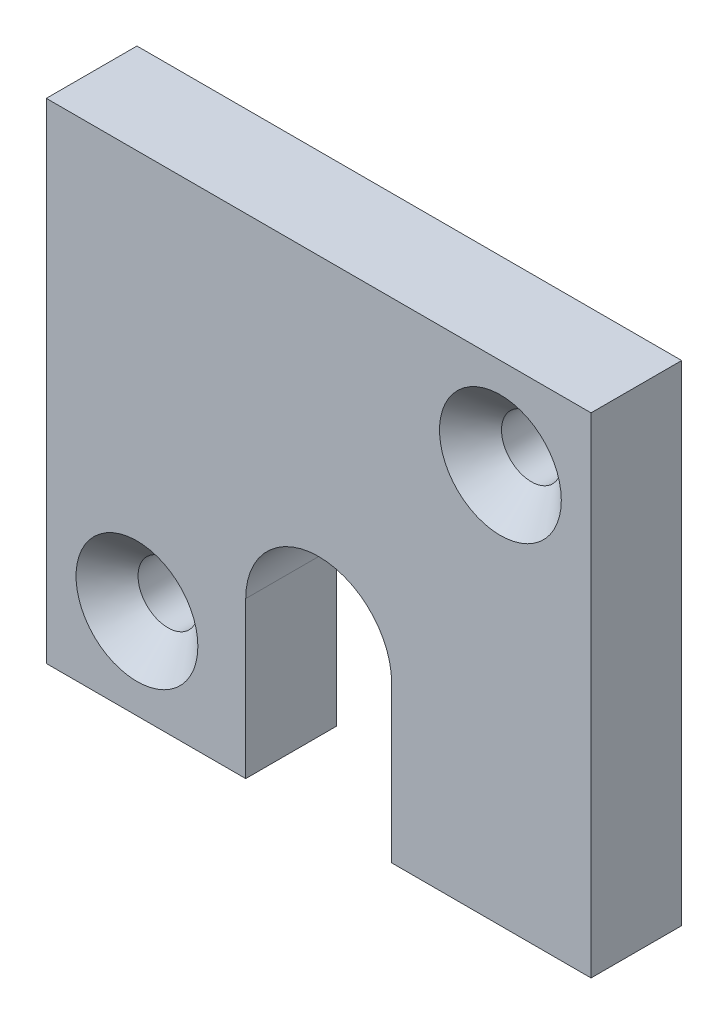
ISO-10303-21;
HEADER;
FILE_DESCRIPTION(('STEP AP214'),'2;1');
FILE_NAME('part.step','',(''),(''),'','','');
FILE_SCHEMA(('AUTOMOTIVE_DESIGN { 1 0 10303 214 1 1 1 1 }'));
ENDSEC;
DATA;
#1=APPLICATION_CONTEXT('core data for automotive mechanical design processes');
#2=APPLICATION_PROTOCOL_DEFINITION('international standard','automotive_design',2000,#1);
#3=PRODUCT_CONTEXT('',#1,'mechanical');
#4=PRODUCT('Part','Part','',(#3));
#5=PRODUCT_RELATED_PRODUCT_CATEGORY('part','',(#4));
#6=PRODUCT_DEFINITION_FORMATION('','',#4);
#7=PRODUCT_DEFINITION_CONTEXT('part definition',#1,'design');
#8=PRODUCT_DEFINITION('design','',#6,#7);
#9=PRODUCT_DEFINITION_SHAPE('','',#8);
#10=(LENGTH_UNIT() NAMED_UNIT(*) SI_UNIT(.MILLI.,.METRE.));
#11=(NAMED_UNIT(*) PLANE_ANGLE_UNIT() SI_UNIT($,.RADIAN.));
#12=(NAMED_UNIT(*) SI_UNIT($,.STERADIAN.) SOLID_ANGLE_UNIT());
#13=UNCERTAINTY_MEASURE_WITH_UNIT(LENGTH_MEASURE(1.E-05),#10,'distance_accuracy_value','');
#14=(GEOMETRIC_REPRESENTATION_CONTEXT(3) GLOBAL_UNCERTAINTY_ASSIGNED_CONTEXT((#13)) GLOBAL_UNIT_ASSIGNED_CONTEXT((#10,
#11,#12)) REPRESENTATION_CONTEXT('',''));
#15=CARTESIAN_POINT('',(0.,0.,0.));
#16=DIRECTION('',(0.,0.,1.));
#17=DIRECTION('',(1.,0.,0.));
#18=AXIS2_PLACEMENT_3D('',#15,#16,#17);
#19=CARTESIAN_POINT('',(0.,0.,10.));
#20=DIRECTION('',(1.,0.,0.));
#21=DIRECTION('',(0.,0.,-1.));
#22=AXIS2_PLACEMENT_3D('',#19,#20,#21);
#23=PLANE('',#22);
#24=DIRECTION('',(0.,-1.,0.));
#25=VECTOR('',#24,1.);
#26=CARTESIAN_POINT('',(0.,0.,0.));
#27=LINE('',#26,#25);
#28=CARTESIAN_POINT('',(0.,54.,0.));
#29=VERTEX_POINT('',#28);
#30=CARTESIAN_POINT('',(0.,0.,0.));
#31=VERTEX_POINT('',#30);
#32=EDGE_CURVE('E100',#29,#31,#27,.T.);
#33=ORIENTED_EDGE('',*,*,#32,.T.);
#34=DIRECTION('',(0.,0.,-1.));
#35=VECTOR('',#34,1.);
#36=CARTESIAN_POINT('',(0.,0.,10.));
#37=LINE('',#36,#35);
#38=CARTESIAN_POINT('',(0.,0.,10.));
#39=VERTEX_POINT('',#38);
#40=EDGE_CURVE('E11',#39,#31,#37,.T.);
#41=ORIENTED_EDGE('',*,*,#40,.F.);
#42=DIRECTION('',(0.,-1.,0.));
#43=VECTOR('',#42,1.);
#44=CARTESIAN_POINT('',(0.,0.,10.));
#45=LINE('',#44,#43);
#46=CARTESIAN_POINT('',(0.,54.,10.));
#47=VERTEX_POINT('',#46);
#48=EDGE_CURVE('E132',#47,#39,#45,.T.);
#49=ORIENTED_EDGE('',*,*,#48,.F.);
#50=DIRECTION('',(0.,0.,-1.));
#51=VECTOR('',#50,1.);
#52=CARTESIAN_POINT('',(0.,54.,10.));
#53=LINE('',#52,#51);
#54=EDGE_CURVE('E113',#47,#29,#53,.T.);
#55=ORIENTED_EDGE('',*,*,#54,.T.);
#56=EDGE_LOOP('',(#33,#41,#49,#55));
#57=FACE_BOUND('',#56,.T.);
#58=ADVANCED_FACE('F32',(#57),#23,.F.);
#59=CARTESIAN_POINT('',(0.,0.,10.));
#60=DIRECTION('',(0.,1.,0.));
#61=DIRECTION('',(0.,0.,1.));
#62=AXIS2_PLACEMENT_3D('',#59,#60,#61);
#63=PLANE('',#62);
#64=DIRECTION('',(1.,0.,0.));
#65=VECTOR('',#64,1.);
#66=CARTESIAN_POINT('',(0.,0.,0.));
#67=LINE('',#66,#65);
#68=CARTESIAN_POINT('',(22.,0.,0.));
#69=VERTEX_POINT('',#68);
#70=EDGE_CURVE('E96',#31,#69,#67,.T.);
#71=ORIENTED_EDGE('',*,*,#70,.T.);
#72=DIRECTION('',(0.,0.,-1.));
#73=VECTOR('',#72,1.);
#74=CARTESIAN_POINT('',(22.,0.,10.));
#75=LINE('',#74,#73);
#76=CARTESIAN_POINT('',(22.,0.,10.));
#77=VERTEX_POINT('',#76);
#78=EDGE_CURVE('E39',#77,#69,#75,.T.);
#79=ORIENTED_EDGE('',*,*,#78,.F.);
#80=DIRECTION('',(1.,0.,0.));
#81=VECTOR('',#80,1.);
#82=CARTESIAN_POINT('',(0.,0.,10.));
#83=LINE('',#82,#81);
#84=EDGE_CURVE('E109',#39,#77,#83,.T.);
#85=ORIENTED_EDGE('',*,*,#84,.F.);
#86=ORIENTED_EDGE('',*,*,#40,.T.);
#87=EDGE_LOOP('',(#71,#79,#85,#86));
#88=FACE_BOUND('',#87,.T.);
#89=ADVANCED_FACE('F108',(#88),#63,.F.);
#90=CARTESIAN_POINT('',(22.,0.,10.));
#91=DIRECTION('',(-1.,0.,0.));
#92=DIRECTION('',(0.,0.,1.));
#93=AXIS2_PLACEMENT_3D('',#90,#91,#92);
#94=PLANE('',#93);
#95=DIRECTION('',(0.,1.,0.));
#96=VECTOR('',#95,1.);
#97=CARTESIAN_POINT('',(22.,0.,0.));
#98=LINE('',#97,#96);
#99=CARTESIAN_POINT('',(22.,17.2,0.));
#100=VERTEX_POINT('',#99);
#101=EDGE_CURVE('E102',#69,#100,#98,.T.);
#102=ORIENTED_EDGE('',*,*,#101,.T.);
#103=DIRECTION('',(0.,0.,-1.));
#104=VECTOR('',#103,1.);
#105=CARTESIAN_POINT('',(22.,17.2,10.));
#106=LINE('',#105,#104);
#107=CARTESIAN_POINT('',(22.,17.2,10.));
#108=VERTEX_POINT('',#107);
#109=EDGE_CURVE('E158',#108,#100,#106,.T.);
#110=ORIENTED_EDGE('',*,*,#109,.F.);
#111=DIRECTION('',(0.,1.,0.));
#112=VECTOR('',#111,1.);
#113=CARTESIAN_POINT('',(22.,0.,10.));
#114=LINE('',#113,#112);
#115=EDGE_CURVE('E135',#77,#108,#114,.T.);
#116=ORIENTED_EDGE('',*,*,#115,.F.);
#117=ORIENTED_EDGE('',*,*,#78,.T.);
#118=EDGE_LOOP('',(#102,#110,#116,#117));
#119=FACE_BOUND('',#118,.T.);
#120=ADVANCED_FACE('F162',(#119),#94,.F.);
#121=CARTESIAN_POINT('',(30.05,17.2,10.));
#122=DIRECTION('',(0.,0.,-1.));
#123=DIRECTION('',(-1.,0.,0.));
#124=AXIS2_PLACEMENT_3D('',#121,#122,#123);
#125=CYLINDRICAL_SURFACE('',#124,8.05);
#126=CARTESIAN_POINT('',(30.05,17.2,0.));
#127=DIRECTION('',(0.,0.,-1.));
#128=DIRECTION('',(1.,0.,0.));
#129=AXIS2_PLACEMENT_3D('',#126,#127,#128);
#130=CIRCLE('',#129,8.05);
#131=CARTESIAN_POINT('',(38.1,17.2,0.));
#132=VERTEX_POINT('',#131);
#133=EDGE_CURVE('E122',#100,#132,#130,.T.);
#134=ORIENTED_EDGE('',*,*,#133,.T.);
#135=DIRECTION('',(0.,0.,-1.));
#136=VECTOR('',#135,1.);
#137=CARTESIAN_POINT('',(38.1,17.2,10.));
#138=LINE('',#137,#136);
#139=CARTESIAN_POINT('',(38.1,17.2,10.));
#140=VERTEX_POINT('',#139);
#141=EDGE_CURVE('E155',#140,#132,#138,.T.);
#142=ORIENTED_EDGE('',*,*,#141,.F.);
#143=CARTESIAN_POINT('',(30.05,17.2,10.));
#144=DIRECTION('',(0.,0.,-1.));
#145=DIRECTION('',(1.,0.,0.));
#146=AXIS2_PLACEMENT_3D('',#143,#144,#145);
#147=CIRCLE('',#146,8.05);
#148=EDGE_CURVE('E137',#108,#140,#147,.T.);
#149=ORIENTED_EDGE('',*,*,#148,.F.);
#150=ORIENTED_EDGE('',*,*,#109,.T.);
#151=EDGE_LOOP('',(#134,#142,#149,#150));
#152=FACE_BOUND('',#151,.T.);
#153=ADVANCED_FACE('F170',(#152),#125,.F.);
#154=CARTESIAN_POINT('',(38.1,0.,10.));
#155=DIRECTION('',(1.,0.,0.));
#156=DIRECTION('',(0.,1.,0.));
#157=AXIS2_PLACEMENT_3D('',#154,#155,#156);
#158=PLANE('',#157);
#159=DIRECTION('',(0.,-1.,0.));
#160=VECTOR('',#159,1.);
#161=CARTESIAN_POINT('',(38.1,0.,0.));
#162=LINE('',#161,#160);
#163=CARTESIAN_POINT('',(38.1,0.,0.));
#164=VERTEX_POINT('',#163);
#165=EDGE_CURVE('E124',#132,#164,#162,.T.);
#166=ORIENTED_EDGE('',*,*,#165,.T.);
#167=DIRECTION('',(0.,0.,-1.));
#168=VECTOR('',#167,1.);
#169=CARTESIAN_POINT('',(38.1,0.,10.));
#170=LINE('',#169,#168);
#171=CARTESIAN_POINT('',(38.1,0.,10.));
#172=VERTEX_POINT('',#171);
#173=EDGE_CURVE('E152',#172,#164,#170,.T.);
#174=ORIENTED_EDGE('',*,*,#173,.F.);
#175=DIRECTION('',(0.,-1.,0.));
#176=VECTOR('',#175,1.);
#177=CARTESIAN_POINT('',(38.1,0.,10.));
#178=LINE('',#177,#176);
#179=EDGE_CURVE('E139',#140,#172,#178,.T.);
#180=ORIENTED_EDGE('',*,*,#179,.F.);
#181=ORIENTED_EDGE('',*,*,#141,.T.);
#182=EDGE_LOOP('',(#166,#174,#180,#181));
#183=FACE_BOUND('',#182,.T.);
#184=ADVANCED_FACE('F173',(#183),#158,.F.);
#185=CARTESIAN_POINT('',(38.1,0.,10.));
#186=DIRECTION('',(0.,1.,0.));
#187=DIRECTION('',(0.,0.,1.));
#188=AXIS2_PLACEMENT_3D('',#185,#186,#187);
#189=PLANE('',#188);
#190=DIRECTION('',(1.,0.,0.));
#191=VECTOR('',#190,1.);
#192=CARTESIAN_POINT('',(38.1,0.,0.));
#193=LINE('',#192,#191);
#194=CARTESIAN_POINT('',(60.1,0.,0.));
#195=VERTEX_POINT('',#194);
#196=EDGE_CURVE('E126',#164,#195,#193,.T.);
#197=ORIENTED_EDGE('',*,*,#196,.T.);
#198=DIRECTION('',(0.,0.,-1.));
#199=VECTOR('',#198,1.);
#200=CARTESIAN_POINT('',(60.1,0.,10.));
#201=LINE('',#200,#199);
#202=CARTESIAN_POINT('',(60.1,0.,10.));
#203=VERTEX_POINT('',#202);
#204=EDGE_CURVE('E149',#203,#195,#201,.T.);
#205=ORIENTED_EDGE('',*,*,#204,.F.);
#206=DIRECTION('',(1.,0.,0.));
#207=VECTOR('',#206,1.);
#208=CARTESIAN_POINT('',(38.1,0.,10.));
#209=LINE('',#208,#207);
#210=EDGE_CURVE('E141',#172,#203,#209,.T.);
#211=ORIENTED_EDGE('',*,*,#210,.F.);
#212=ORIENTED_EDGE('',*,*,#173,.T.);
#213=EDGE_LOOP('',(#197,#205,#211,#212));
#214=FACE_BOUND('',#213,.T.);
#215=ADVANCED_FACE('F178',(#214),#189,.F.);
#216=CARTESIAN_POINT('',(60.1,0.,10.));
#217=DIRECTION('',(-1.,0.,0.));
#218=DIRECTION('',(0.,0.,1.));
#219=AXIS2_PLACEMENT_3D('',#216,#217,#218);
#220=PLANE('',#219);
#221=DIRECTION('',(0.,1.,0.));
#222=VECTOR('',#221,1.);
#223=CARTESIAN_POINT('',(60.1,0.,0.));
#224=LINE('',#223,#222);
#225=CARTESIAN_POINT('',(60.1,54.,0.));
#226=VERTEX_POINT('',#225);
#227=EDGE_CURVE('E128',#195,#226,#224,.T.);
#228=ORIENTED_EDGE('',*,*,#227,.T.);
#229=DIRECTION('',(0.,0.,-1.));
#230=VECTOR('',#229,1.);
#231=CARTESIAN_POINT('',(60.1,54.,10.));
#232=LINE('',#231,#230);
#233=CARTESIAN_POINT('',(60.1,54.,10.));
#234=VERTEX_POINT('',#233);
#235=EDGE_CURVE('E146',#234,#226,#232,.T.);
#236=ORIENTED_EDGE('',*,*,#235,.F.);
#237=DIRECTION('',(0.,1.,0.));
#238=VECTOR('',#237,1.);
#239=CARTESIAN_POINT('',(60.1,0.,10.));
#240=LINE('',#239,#238);
#241=EDGE_CURVE('E51',#203,#234,#240,.T.);
#242=ORIENTED_EDGE('',*,*,#241,.F.);
#243=ORIENTED_EDGE('',*,*,#204,.T.);
#244=EDGE_LOOP('',(#228,#236,#242,#243));
#245=FACE_BOUND('',#244,.T.);
#246=ADVANCED_FACE('F181',(#245),#220,.F.);
#247=CARTESIAN_POINT('',(0.,54.,10.));
#248=DIRECTION('',(0.,-1.,0.));
#249=DIRECTION('',(0.,0.,-1.));
#250=AXIS2_PLACEMENT_3D('',#247,#248,#249);
#251=PLANE('',#250);
#252=DIRECTION('',(-1.,0.,0.));
#253=VECTOR('',#252,1.);
#254=CARTESIAN_POINT('',(0.,54.,0.));
#255=LINE('',#254,#253);
#256=EDGE_CURVE('E130',#226,#29,#255,.T.);
#257=ORIENTED_EDGE('',*,*,#256,.T.);
#258=ORIENTED_EDGE('',*,*,#54,.F.);
#259=DIRECTION('',(-1.,0.,0.));
#260=VECTOR('',#259,1.);
#261=CARTESIAN_POINT('',(0.,54.,10.));
#262=LINE('',#261,#260);
#263=EDGE_CURVE('E46',#234,#47,#262,.T.);
#264=ORIENTED_EDGE('',*,*,#263,.F.);
#265=ORIENTED_EDGE('',*,*,#235,.T.);
#266=EDGE_LOOP('',(#257,#258,#264,#265));
#267=FACE_BOUND('',#266,.T.);
#268=ADVANCED_FACE('F183',(#267),#251,.F.);
#269=CARTESIAN_POINT('',(30.05,17.2,10.));
#270=DIRECTION('',(0.,0.,1.));
#271=DIRECTION('',(1.,0.,0.));
#272=AXIS2_PLACEMENT_3D('',#269,#270,#271);
#273=PLANE('',#272);
#274=CARTESIAN_POINT('',(10.,10.,10.));
#275=DIRECTION('',(0.,0.,1.));
#276=DIRECTION('',(1.,0.,0.));
#277=AXIS2_PLACEMENT_3D('',#274,#275,#276);
#278=CIRCLE('',#277,6.72);
#279=CARTESIAN_POINT('',(16.72,10.,10.));
#280=VERTEX_POINT('',#279);
#281=EDGE_CURVE('E285',#280,#280,#278,.T.);
#282=ORIENTED_EDGE('',*,*,#281,.F.);
#283=EDGE_LOOP('',(#282));
#284=FACE_BOUND('',#283,.T.);
#285=CARTESIAN_POINT('',(50.1,44.,10.));
#286=DIRECTION('',(0.,0.,1.));
#287=DIRECTION('',(1.,0.,0.));
#288=AXIS2_PLACEMENT_3D('',#285,#286,#287);
#289=CIRCLE('',#288,6.72);
#290=CARTESIAN_POINT('',(56.82,44.,10.));
#291=VERTEX_POINT('',#290);
#292=EDGE_CURVE('E114',#291,#291,#289,.T.);
#293=ORIENTED_EDGE('',*,*,#292,.F.);
#294=EDGE_LOOP('',(#293));
#295=FACE_BOUND('',#294,.T.);
#296=ORIENTED_EDGE('',*,*,#48,.T.);
#297=ORIENTED_EDGE('',*,*,#84,.T.);
#298=ORIENTED_EDGE('',*,*,#115,.T.);
#299=ORIENTED_EDGE('',*,*,#148,.T.);
#300=ORIENTED_EDGE('',*,*,#179,.T.);
#301=ORIENTED_EDGE('',*,*,#210,.T.);
#302=ORIENTED_EDGE('',*,*,#241,.T.);
#303=ORIENTED_EDGE('',*,*,#263,.T.);
#304=EDGE_LOOP('',(#296,#297,#298,#299,#300,#301,#302,#303));
#305=FACE_BOUND('',#304,.T.);
#306=ADVANCED_FACE('F165',(#284,#295,#305),#273,.T.);
#307=CARTESIAN_POINT('',(30.05,17.2,0.));
#308=DIRECTION('',(0.,0.,1.));
#309=DIRECTION('',(1.,0.,0.));
#310=AXIS2_PLACEMENT_3D('',#307,#308,#309);
#311=PLANE('',#310);
#312=CARTESIAN_POINT('',(10.,10.,0.));
#313=DIRECTION('',(0.,0.,1.));
#314=DIRECTION('',(1.,0.,0.));
#315=AXIS2_PLACEMENT_3D('',#312,#313,#314);
#316=CIRCLE('',#315,3.3);
#317=CARTESIAN_POINT('',(13.3,10.,0.));
#318=VERTEX_POINT('',#317);
#319=EDGE_CURVE('E281',#318,#318,#316,.T.);
#320=ORIENTED_EDGE('',*,*,#319,.T.);
#321=EDGE_LOOP('',(#320));
#322=FACE_BOUND('',#321,.T.);
#323=CARTESIAN_POINT('',(50.1,44.,0.));
#324=DIRECTION('',(0.,0.,1.));
#325=DIRECTION('',(1.,0.,0.));
#326=AXIS2_PLACEMENT_3D('',#323,#324,#325);
#327=CIRCLE('',#326,3.3);
#328=CARTESIAN_POINT('',(53.4,44.,0.));
#329=VERTEX_POINT('',#328);
#330=EDGE_CURVE('E288',#329,#329,#327,.T.);
#331=ORIENTED_EDGE('',*,*,#330,.T.);
#332=EDGE_LOOP('',(#331));
#333=FACE_BOUND('',#332,.T.);
#334=ORIENTED_EDGE('',*,*,#32,.F.);
#335=ORIENTED_EDGE('',*,*,#256,.F.);
#336=ORIENTED_EDGE('',*,*,#227,.F.);
#337=ORIENTED_EDGE('',*,*,#196,.F.);
#338=ORIENTED_EDGE('',*,*,#165,.F.);
#339=ORIENTED_EDGE('',*,*,#133,.F.);
#340=ORIENTED_EDGE('',*,*,#101,.F.);
#341=ORIENTED_EDGE('',*,*,#70,.F.);
#342=EDGE_LOOP('',(#334,#335,#336,#337,#338,#339,#340,#341));
#343=FACE_BOUND('',#342,.T.);
#344=ADVANCED_FACE('F97',(#322,#333,#343),#311,.F.);
#345=CARTESIAN_POINT('',(50.1,44.,10.));
#346=DIRECTION('',(0.,0.,1.));
#347=DIRECTION('',(1.,0.,0.));
#348=AXIS2_PLACEMENT_3D('',#345,#346,#347);
#349=CONICAL_SURFACE('',#348,6.72,0.785398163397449);
#350=CARTESIAN_POINT('',(50.1,44.,6.58));
#351=DIRECTION('',(0.,0.,1.));
#352=DIRECTION('',(1.,0.,0.));
#353=AXIS2_PLACEMENT_3D('',#350,#351,#352);
#354=CIRCLE('',#353,3.3);
#355=CARTESIAN_POINT('',(53.4,44.,6.58));
#356=VERTEX_POINT('',#355);
#357=EDGE_CURVE('E117',#356,#356,#354,.T.);
#358=ORIENTED_EDGE('',*,*,#357,.F.);
#359=EDGE_LOOP('',(#358));
#360=FACE_BOUND('',#359,.T.);
#361=ORIENTED_EDGE('',*,*,#292,.T.);
#362=EDGE_LOOP('',(#361));
#363=FACE_BOUND('',#362,.T.);
#364=ADVANCED_FACE('F225',(#360,#363),#349,.F.);
#365=CARTESIAN_POINT('',(50.1,44.,10.));
#366=DIRECTION('',(0.,0.,1.));
#367=DIRECTION('',(1.,0.,0.));
#368=AXIS2_PLACEMENT_3D('',#365,#366,#367);
#369=CYLINDRICAL_SURFACE('',#368,3.3);
#370=ORIENTED_EDGE('',*,*,#330,.F.);
#371=EDGE_LOOP('',(#370));
#372=FACE_BOUND('',#371,.T.);
#373=ORIENTED_EDGE('',*,*,#357,.T.);
#374=EDGE_LOOP('',(#373));
#375=FACE_BOUND('',#374,.T.);
#376=ADVANCED_FACE('F230',(#372,#375),#369,.F.);
#377=CARTESIAN_POINT('',(10.,10.,10.));
#378=DIRECTION('',(0.,0.,1.));
#379=DIRECTION('',(1.,0.,0.));
#380=AXIS2_PLACEMENT_3D('',#377,#378,#379);
#381=CONICAL_SURFACE('',#380,6.72,0.785398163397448);
#382=CARTESIAN_POINT('',(10.,10.,6.58));
#383=DIRECTION('',(0.,0.,1.));
#384=DIRECTION('',(1.,0.,0.));
#385=AXIS2_PLACEMENT_3D('',#382,#383,#384);
#386=CIRCLE('',#385,3.3);
#387=CARTESIAN_POINT('',(13.3,10.,6.58));
#388=VERTEX_POINT('',#387);
#389=EDGE_CURVE('E284',#388,#388,#386,.T.);
#390=ORIENTED_EDGE('',*,*,#389,.F.);
#391=EDGE_LOOP('',(#390));
#392=FACE_BOUND('',#391,.T.);
#393=ORIENTED_EDGE('',*,*,#281,.T.);
#394=EDGE_LOOP('',(#393));
#395=FACE_BOUND('',#394,.T.);
#396=ADVANCED_FACE('F242',(#392,#395),#381,.F.);
#397=CARTESIAN_POINT('',(10.,10.,10.));
#398=DIRECTION('',(0.,0.,1.));
#399=DIRECTION('',(1.,0.,0.));
#400=AXIS2_PLACEMENT_3D('',#397,#398,#399);
#401=CYLINDRICAL_SURFACE('',#400,3.3);
#402=ORIENTED_EDGE('',*,*,#319,.F.);
#403=EDGE_LOOP('',(#402));
#404=FACE_BOUND('',#403,.T.);
#405=ORIENTED_EDGE('',*,*,#389,.T.);
#406=EDGE_LOOP('',(#405));
#407=FACE_BOUND('',#406,.T.);
#408=ADVANCED_FACE('F264',(#404,#407),#401,.F.);
#409=CLOSED_SHELL('',(#58,#89,#120,#153,#184,#215,#246,#268,#306,#344,#364,#376,#396,#408));
#410=MANIFOLD_SOLID_BREP('B2',#409);
#411=ADVANCED_BREP_SHAPE_REPRESENTATION('',(#18,#410),#14);
#412=SHAPE_DEFINITION_REPRESENTATION(#9,#411);
ENDSEC;
END-ISO-10303-21;
